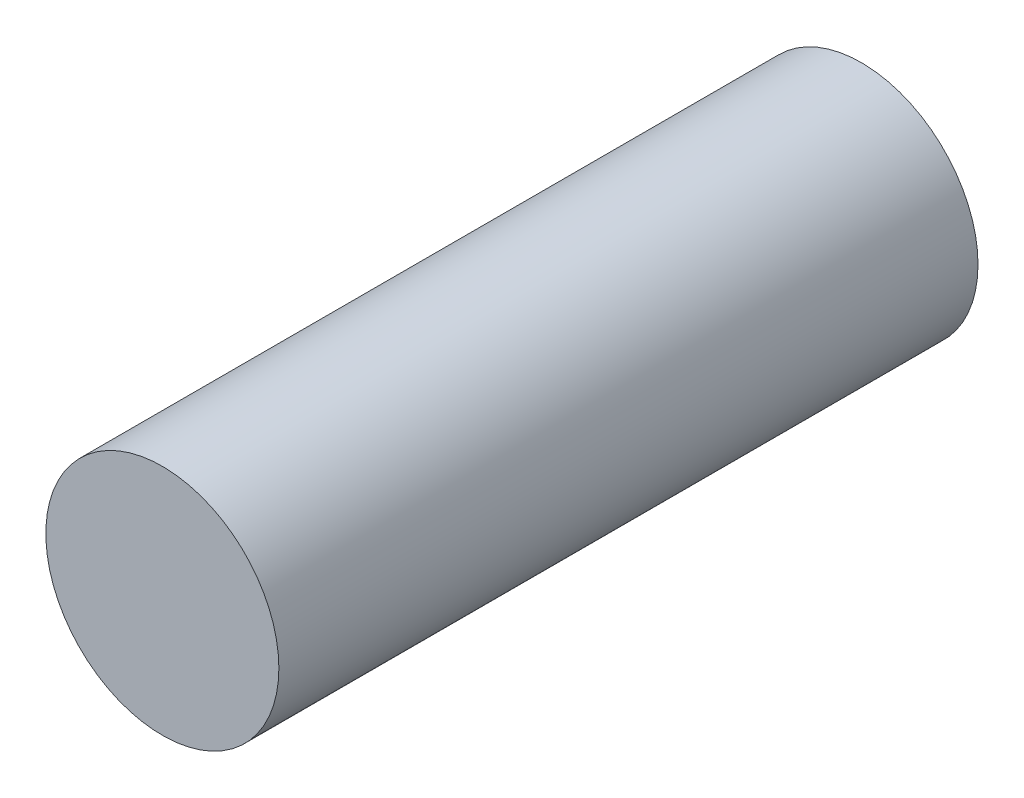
from build123d import *

# Parameters (mm, degrees)
SKETCH1_R           = 2.5
BOSS_EXTRUDE1_DEPTH = 15


with BuildPart() as part:
    # Sketch1 → Boss-Extrude1 (new body)
    with BuildSketch(Plane.XY):
        Circle(SKETCH1_R)
    extrude(amount=BOSS_EXTRUDE1_DEPTH)


solid = part.part
